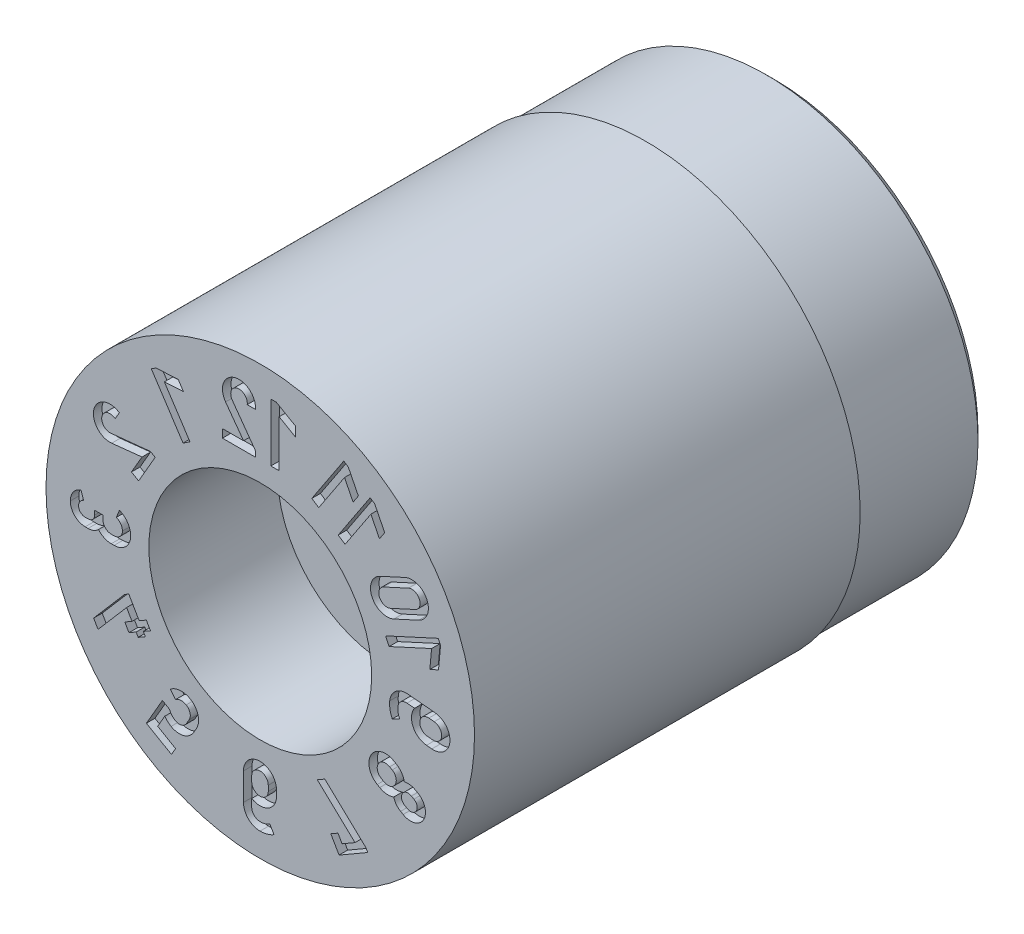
from build123d import *

# Parameters (mm, degrees)
SKETCH4_W          = 3
SKETCH4_H          = 1
CUT_EXTRUDE1_DEPTH = 0.2


with BuildPart() as part:
    # Sketch1 → Revolve1 (revolve)
    with BuildSketch(Plane(origin=(0, 0, 0), x_dir=(0, 0, -1), z_dir=(1, 0, 0)), mode=Mode.PRIVATE) as revolve1_sk:
        Polygon((0, 5), (0, 2.6), (3, 2.6), (3, 1.25), (12, 1.25), (12, 4.75), (11.75, 5), align=None)
    revolve(revolve1_sk.sketch.rotate(Axis((0, 0, 3.797909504), (0, 0, -1)), 90), axis=Axis((0, 0, 3.797909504), (0, 0, -1)))

    # Sketch4 → Cut-Revolve1 (revolve, cut)
    with BuildSketch(Plane(origin=(0, 0, 0), x_dir=(0, 0, -1), z_dir=(1, 0, 0)), mode=Mode.PRIVATE) as cut_revolve1_sk:
        with Locations((10.5, 5.435)):
            Rectangle(SKETCH4_W, SKETCH4_H)
    revolve(cut_revolve1_sk.sketch.rotate(Axis((0, 0, 0), (0, 0, -1)), 90), axis=Axis((0, 0, 0), (0, 0, -1)), mode=Mode.SUBTRACT)

    # Sketch2 → Cut-Extrude1 (cut)
    # profile 1 of 15: a face of its own
    with BuildSketch(Plane.XY):
        Polygon((2.564556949, 3.578972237), (2.670626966, 3.508867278), (2.904539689, 3.042521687), (2.78171437, 2.856684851), (2.581881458, 3.254933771), (1.980189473, 2.34456337), (1.819076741, 2.451047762), align=None)
    # profile 2 of 15: a face of its own
    with BuildSketch(Plane.XY):
        Polygon((1.949505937, 4.012786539), (2.055575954, 3.94268158), (2.289488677, 3.476335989), (2.166663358, 3.290499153), (1.966830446, 3.688748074), (1.365138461, 2.778377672), (1.204025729, 2.884862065), align=None)
    # profile 3 of 15: a face of its own
    with BuildSketch(Plane.XY):
        with BuildLine():
            Line((4.076393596, -0.008725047), (3.441756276, 0.05038586))
            ThreePointArc((3.441756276, 0.05038586), (3.159300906, -0.036896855), (3.021230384, -0.298308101))
            ThreePointArc((3.021230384, -0.298308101), (3.028462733, -0.470123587), (3.081399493, -0.633740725))
            Line((3.081399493, -0.633740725), (3.255792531, -0.549908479))
            ThreePointArc((3.255792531, -0.549908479), (3.214932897, -0.429103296), (3.215487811, -0.30157646))
            ThreePointArc((3.215487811, -0.30157646), (3.288338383, -0.180916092), (3.423779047, -0.141903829))
            Line((3.423779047, -0.141903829), (3.600296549, -0.158391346))
            ThreePointArc((3.600296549, -0.158391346), (3.563573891, -0.543531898), (3.879570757, -0.766753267))
            Line((3.879570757, -0.766753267), (4.004350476, -0.777961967))
            ThreePointArc((4.004350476, -0.777961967), (4.424990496, -0.429365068), (4.076393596, -0.008725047))
        make_face()
        with BuildLine():
            Line((4.058440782, -0.201119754), (3.9334623, -0.189457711))
            ThreePointArc((3.9334623, -0.189457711), (3.723202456, -0.36383315), (3.897585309, -0.574086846))
            Line((3.897585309, -0.574086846), (4.022536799, -0.585746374))
            ThreePointArc((4.022536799, -0.585746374), (4.232802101, -0.411385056), (4.058440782, -0.201119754))
        make_face(mode=Mode.SUBTRACT)
    # profile 4 of 15: a face of its own
    with BuildSketch(Plane.XY):
        Polygon((1.330932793, -2.738470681), (1.505534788, -2.637664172), (2.462388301, -3.539366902), (2.508735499, -3.619642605), (1.839646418, -4.005941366), (1.646497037, -3.671396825), (1.813792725, -3.574808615), (1.910353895, -3.742057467), (2.211411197, -3.568241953), align=None)
    # profile 5 of 15: a face of its own
    with BuildSketch(Plane.XY):
        with BuildLine():
            Line((3.174357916, -1.497952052), (3.115864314, -1.464118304))
            ThreePointArc((3.115864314, -1.464118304), (2.58790253, -1.605358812), (2.729565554, -2.133207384))
            Line((2.729565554, -2.133207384), (2.788066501, -2.166982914))
            ThreePointArc((2.788066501, -2.166982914), (2.94808184, -2.217327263), (3.114348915, -2.19508492))
            ThreePointArc((3.114348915, -2.19508492), (3.17446898, -2.315449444), (3.27574215, -2.404025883))
            Line((3.27574215, -2.404025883), (3.334302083, -2.437779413))
            ThreePointArc((3.334302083, -2.437779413), (3.809090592, -2.310533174), (3.681844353, -1.835744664))
            Line((3.681844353, -1.835744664), (3.623427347, -1.801767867))
            ThreePointArc((3.623427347, -1.801767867), (3.496145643, -1.758101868), (3.361841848, -1.766459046))
            ThreePointArc((3.361841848, -1.766459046), (3.297960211, -1.611355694), (3.174357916, -1.497952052))
        make_face()
        with BuildLine():
            Line((3.372295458, -2.236773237), (3.430854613, -2.270519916))
            ThreePointArc((3.430854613, -2.270519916), (3.641917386, -2.213965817), (3.585363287, -2.002903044))
            Line((3.585363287, -2.002903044), (3.526858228, -1.969062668))
            ThreePointArc((3.526858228, -1.969062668), (3.315507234, -2.025512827), (3.372295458, -2.236773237))
        make_face(mode=Mode.SUBTRACT)
        with BuildLine():
            Line((2.826095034, -1.965949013), (2.884682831, -1.999774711))
            ThreePointArc((2.884682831, -1.999774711), (3.148484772, -1.929056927), (3.077766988, -1.665254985))
            Line((3.077766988, -1.665254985), (3.019271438, -1.631357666))
            ThreePointArc((3.019271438, -1.631357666), (2.755457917, -1.702105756), (2.826095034, -1.965949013))
        make_face(mode=Mode.SUBTRACT)
    # profile 6 of 15: a face of its own
    with BuildSketch(Plane.XY):
        Polygon((4.154625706, 1.532033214), (4.207692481, 1.416493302), (4.160123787, 0.896944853), (3.957695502, 0.80397078), (3.998253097, 1.247694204), (3.006605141, 0.792236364), (2.926000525, 0.967733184), align=None)
    # profile 7 of 15: a face of its own
    with BuildSketch(Plane.XY):
        with BuildLine():
            Line((3.376511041, 2.373358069), (2.797302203, 2.107330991))
            ThreePointArc((2.797302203, 2.107330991), (2.607454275, 1.594988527), (3.119796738, 1.405140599))
            Line((3.119796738, 1.405140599), (3.699019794, 1.671174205))
            ThreePointArc((3.699019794, 1.671174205), (3.888857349, 2.183520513), (3.376511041, 2.373358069))
        make_face()
        with BuildLine():
            Line((3.039189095, 1.580695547), (3.618412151, 1.846729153))
            ThreePointArc((3.618412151, 1.846729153), (3.713306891, 2.102903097), (3.457138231, 2.197812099))
            Line((3.457138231, 2.197812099), (2.877922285, 1.931781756))
            ThreePointArc((2.877922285, 1.931781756), (2.783006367, 1.67560239), (3.039189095, 1.580695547))
        make_face(mode=Mode.SUBTRACT)
    # profile 8 of 15: a face of its own
    with BuildSketch(Plane.XY):
        Polygon((0.247252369, 4.414192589), (0.3743962, 4.414192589), (0.82667347, 4.154118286), (0.82667347, 3.931359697), (0.440374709, 4.153415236), (0.440374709, 3.062173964), (0.247252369, 3.062173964), align=None)
    # profile 9 of 15: a face of its own
    with BuildSketch(Plane.XY):
        with BuildLine():
            Line((-0.881998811, 3.05921193), (-0.109401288, 3.05921193))
            Line((-0.109401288, 3.05921193), (-0.109401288, 3.18695065))
            Line((-0.109401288, 3.18695065), (-0.65253421, 3.940998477))
            ThreePointArc((-0.65253421, 3.940998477), (-0.541087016, 4.241735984), (-0.304740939, 4.024931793))
            Line((-0.304740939, 4.024931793), (-0.110474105, 4.024926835))
            ThreePointArc((-0.110474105, 4.024926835), (-0.600688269, 4.425675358), (-0.809515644, 3.827929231))
            Line((-0.809515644, 3.827929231), (-0.389431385, 3.252388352))
            Line((-0.389431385, 3.252388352), (-0.881998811, 3.252388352))
            Line((-0.881998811, 3.252388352), (-0.881998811, 3.05921193))
        make_face()
    # profile 10 of 15: a face of its own
    with BuildSketch(Plane.XY):
        Polygon((-2.541847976, 3.631544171), (-2.435465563, 3.701174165), (-1.914611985, 3.731256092), (-1.792618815, 3.544871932), (-2.237446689, 3.519112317), (-1.639831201, 2.606060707), (-1.801418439, 2.500297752), align=None)
    # profile 11 of 15: a face of its own
    with BuildSketch(Plane.XY):
        with BuildLine():
            Line((0.380120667, -3.420714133), (0.380553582, -3.545995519))
            ThreePointArc((0.380553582, -3.545995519), (0.18765662, -3.88136481), (-0.199229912, -3.880583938))
            Line((-0.199229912, -3.880583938), (-0.199246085, -4.05786977))
            ThreePointArc((-0.199246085, -4.05786977), (-0.147818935, -4.18910002), (-0.020912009, -4.250425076))
            ThreePointArc((-0.020912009, -4.250425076), (0.106105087, -4.23913105), (0.222583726, -4.187230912))
            Line((0.222583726, -4.187230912), (0.322279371, -4.353095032))
            ThreePointArc((0.322279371, -4.353095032), (0.164288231, -4.421004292), (-0.00611214, -4.444168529))
            ThreePointArc((-0.00611214, -4.444168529), (-0.27922065, -4.33098262), (-0.392368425, -4.057858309))
            Line((-0.392368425, -4.057858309), (-0.392476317, -3.42045041))
            ThreePointArc((-0.392476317, -3.42045041), (-0.006045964, -3.03428378), (0.380120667, -3.420714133))
        make_face()
        with BuildLine():
            Line((-0.199246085, -3.42047411), (-0.199246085, -3.545995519))
            ThreePointArc((-0.199246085, -3.545995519), (-0.006089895, -3.739144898), (0.187052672, -3.545981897))
            Line((0.187052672, -3.545981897), (0.187052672, -3.420487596))
            ThreePointArc((0.187052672, -3.420487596), (-0.006089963, -3.227331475), (-0.199246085, -3.42047411))
        make_face(mode=Mode.SUBTRACT)
    # profile 12 of 15: a face of its own
    with BuildSketch(Plane.XY):
        with BuildLine():
            Line((-2.228693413, -3.233959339), (-2.393693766, -3.519748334))
            Line((-2.393693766, -3.519748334), (-1.975503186, -3.761190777))
            Line((-1.975503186, -3.761190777), (-2.072096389, -3.928495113))
            Line((-2.072096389, -3.928495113), (-2.657537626, -3.590490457))
            Line((-2.657537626, -3.590490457), (-2.282649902, -2.941165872))
            Line((-2.282649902, -2.941165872), (-2.11540105, -3.037727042))
            ThreePointArc((-2.11540105, -3.037727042), (-2.064992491, -3.129969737), (-1.985011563, -3.19818109))
            ThreePointArc((-1.985011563, -3.19818109), (-1.838455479, -3.217487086), (-1.721210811, -3.127458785))
            Line((-1.721210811, -3.127458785), (-1.658394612, -3.018766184))
            ThreePointArc((-1.658394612, -3.018766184), (-1.639071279, -2.872192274), (-1.729110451, -2.754930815))
            ThreePointArc((-1.729110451, -2.754930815), (-1.856567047, -2.725823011), (-1.97834099, -2.773399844))
            Line((-1.97834099, -2.773399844), (-2.098591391, -2.622042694))
            ThreePointArc((-2.098591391, -2.622042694), (-1.870871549, -2.533005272), (-1.632542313, -2.587623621))
            ThreePointArc((-1.632542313, -2.587623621), (-1.452657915, -2.822221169), (-1.491147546, -3.115330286))
            Line((-1.491147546, -3.115330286), (-1.554029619, -3.223920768))
            ThreePointArc((-1.554029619, -3.223920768), (-1.788584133, -3.40369915), (-2.081619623, -3.365407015))
            ThreePointArc((-2.081619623, -3.365407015), (-2.161998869, -3.307338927), (-2.228693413, -3.233959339))
        make_face()
    # profile 13 of 15: a face of its own
    with BuildSketch(Plane.XY):
        with BuildLine():
            Line((-3.409955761, -0.179023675), (-3.477558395, -0.179023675))
            ThreePointArc((-3.477558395, -0.179023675), (-3.614100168, -0.122466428), (-3.670657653, 0.014075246))
            Line((-3.670657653, 0.014075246), (-3.670657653, 0.110632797))
            Line((-3.670657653, 0.110632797), (-3.863834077, 0.110632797))
            Line((-3.863834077, 0.110632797), (-3.863834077, 0.014098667))
            ThreePointArc((-3.863834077, 0.014098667), (-3.909088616, -0.095155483), (-4.018342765, -0.140410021))
            Line((-4.018342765, -0.140410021), (-4.085936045, -0.140410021))
            ThreePointArc((-4.085936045, -0.140410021), (-4.195151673, -0.095117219), (-4.240452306, 0.014095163))
            ThreePointArc((-4.240452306, 0.014095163), (-4.207897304, 0.115469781), (-4.122285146, 0.178772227))
            Line((-4.122285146, 0.178772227), (-4.184100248, 0.361783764))
            ThreePointArc((-4.184100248, 0.361783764), (-4.36475286, 0.228072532), (-4.433605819, 0.014125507))
            ThreePointArc((-4.433605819, 0.014125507), (-4.331793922, -0.231758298), (-4.085916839, -0.333586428))
            Line((-4.085916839, -0.333586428), (-4.018342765, -0.333586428))
            ThreePointArc((-4.018342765, -0.333586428), (-3.886383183, -0.307557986), (-3.774190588, -0.233371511))
            ThreePointArc((-3.774190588, -0.233371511), (-3.641318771, -0.335794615), (-3.477550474, -0.372200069))
            Line((-3.477550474, -0.372200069), (-3.409923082, -0.372200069))
            ThreePointArc((-3.409923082, -0.372200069), (-3.136795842, -0.259055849), (-3.023689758, 0.014087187))
            ThreePointArc((-3.023689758, 0.014087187), (-3.095656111, 0.247711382), (-3.286564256, 0.400398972))
            Line((-3.286564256, 0.400398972), (-3.357432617, 0.220775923))
            ThreePointArc((-3.357432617, 0.220775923), (-3.255301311, 0.139100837), (-3.216812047, 0.014120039))
            ThreePointArc((-3.216812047, 0.014120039), (-3.273382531, -0.122453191), (-3.409955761, -0.179023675))
        make_face()
    # profile 14 of 15: a face of its own
    with BuildSketch(Plane.XY):
        Polygon((-3.888059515, -2.080559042), (-3.785765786, -2.257736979), (-3.118430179, -1.482156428), (-2.993314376, -1.698863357), (-3.160563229, -1.795424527), (-3.064002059, -1.96267338), (-2.896753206, -1.86611221), (-2.848459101, -1.949760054), (-2.681210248, -1.853198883), (-2.729504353, -1.769551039), (-2.562208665, -1.672962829), (-2.658769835, -1.505713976), (-2.826065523, -1.602302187), (-3.067509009, -1.184109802), (-3.165301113, -1.2405701), align=None)
    # profile 15 of 15: a face of its own
    with BuildSketch(Plane.XY):
        with BuildLine():
            Line((-3.005562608, 1.314066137), (-2.83826692, 1.217477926))
            Line((-2.83826692, 1.217477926), (-2.451967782, 1.886567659))
            Line((-2.451967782, 1.886567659), (-2.562590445, 1.950435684))
            Line((-2.562590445, 1.950435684), (-3.48718148, 1.857092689))
            ThreePointArc((-3.48718148, 1.857092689), (-3.691894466, 2.103966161), (-3.385977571, 2.200240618))
            Line((-3.385977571, 2.200240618), (-3.288844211, 2.368489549))
            ThreePointArc((-3.288844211, 2.368489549), (-3.880998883, 2.144324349), (-3.467754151, 1.664609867))
            Line((-3.467754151, 1.664609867), (-2.759278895, 1.74064204))
            Line((-2.759278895, 1.74064204), (-3.005562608, 1.314066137))
        make_face()
    extrude(amount=-CUT_EXTRUDE1_DEPTH, mode=Mode.SUBTRACT)


solid = part.part
